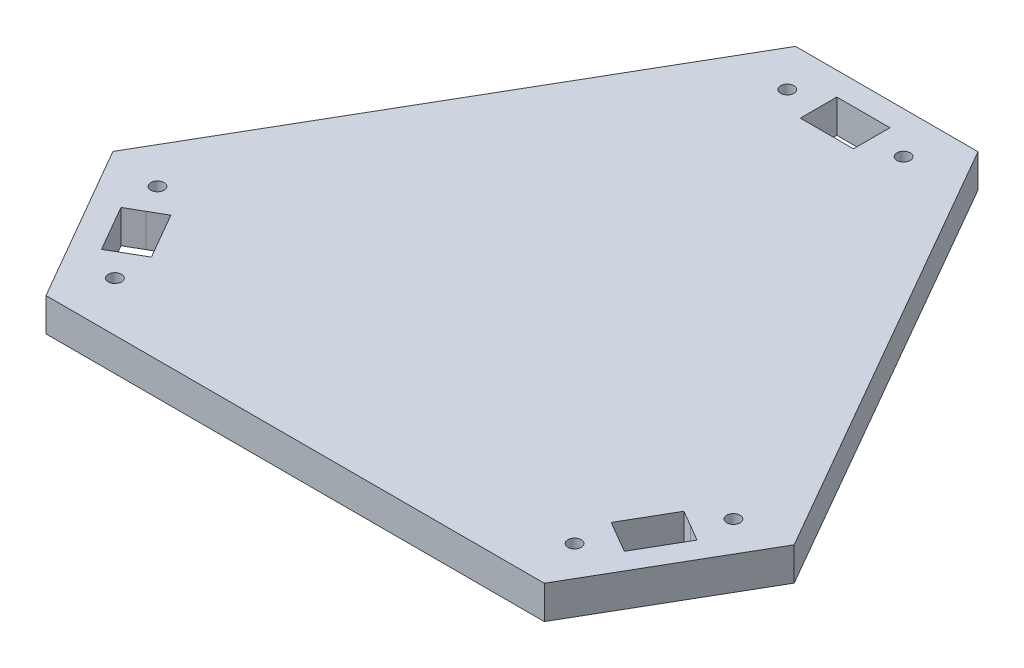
ISO-10303-21;
HEADER;
FILE_DESCRIPTION(('STEP AP214'),'2;1');
FILE_NAME('part.step','',(''),(''),'','','');
FILE_SCHEMA(('AUTOMOTIVE_DESIGN { 1 0 10303 214 1 1 1 1 }'));
ENDSEC;
DATA;
#1=APPLICATION_CONTEXT('core data for automotive mechanical design processes');
#2=APPLICATION_PROTOCOL_DEFINITION('international standard','automotive_design',2000,#1);
#3=PRODUCT_CONTEXT('',#1,'mechanical');
#4=PRODUCT('Part','Part','',(#3));
#5=PRODUCT_RELATED_PRODUCT_CATEGORY('part','',(#4));
#6=PRODUCT_DEFINITION_FORMATION('','',#4);
#7=PRODUCT_DEFINITION_CONTEXT('part definition',#1,'design');
#8=PRODUCT_DEFINITION('design','',#6,#7);
#9=PRODUCT_DEFINITION_SHAPE('','',#8);
#10=(LENGTH_UNIT() NAMED_UNIT(*) SI_UNIT(.MILLI.,.METRE.));
#11=(NAMED_UNIT(*) PLANE_ANGLE_UNIT() SI_UNIT($,.RADIAN.));
#12=(NAMED_UNIT(*) SI_UNIT($,.STERADIAN.) SOLID_ANGLE_UNIT());
#13=UNCERTAINTY_MEASURE_WITH_UNIT(LENGTH_MEASURE(1.E-05),#10,'distance_accuracy_value','');
#14=(GEOMETRIC_REPRESENTATION_CONTEXT(3) GLOBAL_UNCERTAINTY_ASSIGNED_CONTEXT((#13)) GLOBAL_UNIT_ASSIGNED_CONTEXT((#10,
#11,#12)) REPRESENTATION_CONTEXT('',''));
#15=CARTESIAN_POINT('',(0.,0.,0.));
#16=DIRECTION('',(0.,0.,1.));
#17=DIRECTION('',(1.,0.,0.));
#18=AXIS2_PLACEMENT_3D('',#15,#16,#17);
#19=CARTESIAN_POINT('',(-54.2371764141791,20.,-355.613027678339));
#20=DIRECTION('',(0.,0.,-1.));
#21=DIRECTION('',(-1.,0.,0.));
#22=AXIS2_PLACEMENT_3D('',#19,#20,#21);
#23=PLANE('',#22);
#24=DIRECTION('',(1.,0.,0.));
#25=VECTOR('',#24,1.);
#26=CARTESIAN_POINT('',(-54.2371764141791,0.,-355.613027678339));
#27=LINE('',#26,#25);
#28=CARTESIAN_POINT('',(-54.2371764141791,0.,-355.613027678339));
#29=VERTEX_POINT('',#28);
#30=CARTESIAN_POINT('',(55.5843421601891,0.,-355.613027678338));
#31=VERTEX_POINT('',#30);
#32=EDGE_CURVE('E306',#29,#31,#27,.T.);
#33=ORIENTED_EDGE('',*,*,#32,.F.);
#34=DIRECTION('',(0.,-1.,0.));
#35=VECTOR('',#34,1.);
#36=CARTESIAN_POINT('',(-54.2371764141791,20.,-355.613027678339));
#37=LINE('',#36,#35);
#38=CARTESIAN_POINT('',(-54.2371764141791,20.,-355.613027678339));
#39=VERTEX_POINT('',#38);
#40=EDGE_CURVE('E11',#39,#29,#37,.T.);
#41=ORIENTED_EDGE('',*,*,#40,.F.);
#42=DIRECTION('',(1.,0.,0.));
#43=VECTOR('',#42,1.);
#44=CARTESIAN_POINT('',(-54.2371764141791,20.,-355.613027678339));
#45=LINE('',#44,#43);
#46=CARTESIAN_POINT('',(55.5843421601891,20.,-355.613027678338));
#47=VERTEX_POINT('',#46);
#48=EDGE_CURVE('E317',#39,#47,#45,.T.);
#49=ORIENTED_EDGE('',*,*,#48,.T.);
#50=DIRECTION('',(0.,-1.,0.));
#51=VECTOR('',#50,1.);
#52=CARTESIAN_POINT('',(55.5843421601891,20.,-355.613027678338));
#53=LINE('',#52,#51);
#54=EDGE_CURVE('E35',#47,#31,#53,.T.);
#55=ORIENTED_EDGE('',*,*,#54,.T.);
#56=EDGE_LOOP('',(#33,#41,#49,#55));
#57=FACE_BOUND('',#56,.T.);
#58=ADVANCED_FACE('F32',(#57),#23,.T.);
#59=CARTESIAN_POINT('',(-54.2371764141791,20.,-355.613027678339));
#60=DIRECTION('',(0.865353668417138,0.,0.501161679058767));
#61=DIRECTION('',(0.501161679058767,0.,-0.865353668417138));
#62=AXIS2_PLACEMENT_3D('',#59,#60,#61);
#63=PLANE('',#62);
#64=DIRECTION('',(-0.501161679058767,0.,0.865353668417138));
#65=VECTOR('',#64,1.);
#66=CARTESIAN_POINT('',(-54.2371764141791,0.,-355.613027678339));
#67=LINE('',#66,#65);
#68=CARTESIAN_POINT('',(-204.994277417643,0.,-95.3014040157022));
#69=VERTEX_POINT('',#68);
#70=EDGE_CURVE('E321',#29,#69,#67,.T.);
#71=ORIENTED_EDGE('',*,*,#70,.T.);
#72=DIRECTION('',(0.,-1.,0.));
#73=VECTOR('',#72,1.);
#74=CARTESIAN_POINT('',(-204.994277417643,20.,-95.3014040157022));
#75=LINE('',#74,#73);
#76=CARTESIAN_POINT('',(-204.994277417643,20.,-95.3014040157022));
#77=VERTEX_POINT('',#76);
#78=EDGE_CURVE('E40',#77,#69,#75,.T.);
#79=ORIENTED_EDGE('',*,*,#78,.F.);
#80=DIRECTION('',(-0.501161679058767,0.,0.865353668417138));
#81=VECTOR('',#80,1.);
#82=CARTESIAN_POINT('',(-54.2371764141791,20.,-355.613027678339));
#83=LINE('',#82,#81);
#84=EDGE_CURVE('E331',#39,#77,#83,.T.);
#85=ORIENTED_EDGE('',*,*,#84,.F.);
#86=ORIENTED_EDGE('',*,*,#40,.T.);
#87=EDGE_LOOP('',(#71,#79,#85,#86));
#88=FACE_BOUND('',#87,.T.);
#89=ADVANCED_FACE('F369',(#88),#63,.F.);
#90=CARTESIAN_POINT('',(-149.988554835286,20.,0.));
#91=DIRECTION('',(-0.866090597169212,0.,0.499887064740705));
#92=DIRECTION('',(0.499887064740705,0.,0.866090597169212));
#93=AXIS2_PLACEMENT_3D('',#90,#91,#92);
#94=PLANE('',#93);
#95=DIRECTION('',(-0.499887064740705,0.,-0.866090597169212));
#96=VECTOR('',#95,1.);
#97=CARTESIAN_POINT('',(-149.988554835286,0.,0.));
#98=LINE('',#97,#96);
#99=CARTESIAN_POINT('',(-149.988554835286,0.,0.));
#100=VERTEX_POINT('',#99);
#101=EDGE_CURVE('E344',#100,#69,#98,.T.);
#102=ORIENTED_EDGE('',*,*,#101,.F.);
#103=DIRECTION('',(0.,-1.,0.));
#104=VECTOR('',#103,1.);
#105=CARTESIAN_POINT('',(-149.988554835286,20.,0.));
#106=LINE('',#105,#104);
#107=CARTESIAN_POINT('',(-149.988554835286,20.,0.));
#108=VERTEX_POINT('',#107);
#109=EDGE_CURVE('E350',#108,#100,#106,.T.);
#110=ORIENTED_EDGE('',*,*,#109,.F.);
#111=DIRECTION('',(-0.499887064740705,0.,-0.866090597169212));
#112=VECTOR('',#111,1.);
#113=CARTESIAN_POINT('',(-149.988554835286,20.,0.));
#114=LINE('',#113,#112);
#115=EDGE_CURVE('E328',#108,#77,#114,.T.);
#116=ORIENTED_EDGE('',*,*,#115,.T.);
#117=ORIENTED_EDGE('',*,*,#78,.T.);
#118=EDGE_LOOP('',(#102,#110,#116,#117));
#119=FACE_BOUND('',#118,.T.);
#120=ADVANCED_FACE('F381',(#119),#94,.T.);
#121=CARTESIAN_POINT('',(-149.988554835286,20.,0.));
#122=DIRECTION('',(0.,0.,-1.));
#123=DIRECTION('',(-1.,0.,0.));
#124=AXIS2_PLACEMENT_3D('',#121,#122,#123);
#125=PLANE('',#124);
#126=DIRECTION('',(1.,0.,0.));
#127=VECTOR('',#126,1.);
#128=CARTESIAN_POINT('',(-149.988554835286,0.,0.));
#129=LINE('',#128,#127);
#130=CARTESIAN_POINT('',(150.075497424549,0.,0.));
#131=VERTEX_POINT('',#130);
#132=EDGE_CURVE('E341',#100,#131,#129,.T.);
#133=ORIENTED_EDGE('',*,*,#132,.T.);
#134=DIRECTION('',(0.,-1.,0.));
#135=VECTOR('',#134,1.);
#136=CARTESIAN_POINT('',(150.075497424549,20.,0.));
#137=LINE('',#136,#135);
#138=CARTESIAN_POINT('',(150.075497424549,20.,0.));
#139=VERTEX_POINT('',#138);
#140=EDGE_CURVE('E352',#139,#131,#137,.T.);
#141=ORIENTED_EDGE('',*,*,#140,.F.);
#142=DIRECTION('',(1.,0.,0.));
#143=VECTOR('',#142,1.);
#144=CARTESIAN_POINT('',(-149.988554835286,20.,0.));
#145=LINE('',#144,#143);
#146=EDGE_CURVE('E326',#108,#139,#145,.T.);
#147=ORIENTED_EDGE('',*,*,#146,.F.);
#148=ORIENTED_EDGE('',*,*,#109,.T.);
#149=EDGE_LOOP('',(#133,#141,#147,#148));
#150=FACE_BOUND('',#149,.T.);
#151=ADVANCED_FACE('F382',(#150),#125,.F.);
#152=CARTESIAN_POINT('',(205.21826345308,20.,-95.3014040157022));
#153=DIRECTION('',(0.865551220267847,0.,0.500820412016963));
#154=DIRECTION('',(0.500820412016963,0.,-0.865551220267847));
#155=AXIS2_PLACEMENT_3D('',#152,#153,#154);
#156=PLANE('',#155);
#157=DIRECTION('',(-0.500820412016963,0.,0.865551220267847));
#158=VECTOR('',#157,1.);
#159=CARTESIAN_POINT('',(205.21826345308,0.,-95.3014040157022));
#160=LINE('',#159,#158);
#161=CARTESIAN_POINT('',(205.21826345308,0.,-95.3014040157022));
#162=VERTEX_POINT('',#161);
#163=EDGE_CURVE('E338',#162,#131,#160,.T.);
#164=ORIENTED_EDGE('',*,*,#163,.F.);
#165=DIRECTION('',(0.,-1.,0.));
#166=VECTOR('',#165,1.);
#167=CARTESIAN_POINT('',(205.21826345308,20.,-95.3014040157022));
#168=LINE('',#167,#166);
#169=CARTESIAN_POINT('',(205.21826345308,20.,-95.3014040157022));
#170=VERTEX_POINT('',#169);
#171=EDGE_CURVE('E353',#170,#162,#168,.T.);
#172=ORIENTED_EDGE('',*,*,#171,.F.);
#173=DIRECTION('',(-0.500820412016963,0.,0.865551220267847));
#174=VECTOR('',#173,1.);
#175=CARTESIAN_POINT('',(205.21826345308,20.,-95.3014040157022));
#176=LINE('',#175,#174);
#177=EDGE_CURVE('E323',#170,#139,#176,.T.);
#178=ORIENTED_EDGE('',*,*,#177,.T.);
#179=ORIENTED_EDGE('',*,*,#140,.T.);
#180=EDGE_LOOP('',(#164,#172,#178,#179));
#181=FACE_BOUND('',#180,.T.);
#182=ADVANCED_FACE('F378',(#181),#156,.T.);
#183=CARTESIAN_POINT('',(205.21826345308,20.,-95.3014040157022));
#184=DIRECTION('',(-0.866971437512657,0.,0.498357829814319));
#185=DIRECTION('',(0.498357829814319,0.,0.866971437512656));
#186=AXIS2_PLACEMENT_3D('',#183,#184,#185);
#187=PLANE('',#186);
#188=DIRECTION('',(-0.498357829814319,0.,-0.866971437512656));
#189=VECTOR('',#188,1.);
#190=CARTESIAN_POINT('',(205.21826345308,0.,-95.3014040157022));
#191=LINE('',#190,#189);
#192=EDGE_CURVE('E335',#162,#31,#191,.T.);
#193=ORIENTED_EDGE('',*,*,#192,.T.);
#194=ORIENTED_EDGE('',*,*,#54,.F.);
#195=DIRECTION('',(-0.498357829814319,0.,-0.866971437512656));
#196=VECTOR('',#195,1.);
#197=CARTESIAN_POINT('',(205.21826345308,20.,-95.3014040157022));
#198=LINE('',#197,#196);
#199=EDGE_CURVE('E320',#170,#47,#198,.T.);
#200=ORIENTED_EDGE('',*,*,#199,.F.);
#201=ORIENTED_EDGE('',*,*,#171,.T.);
#202=EDGE_LOOP('',(#193,#194,#200,#201));
#203=FACE_BOUND('',#202,.T.);
#204=ADVANCED_FACE('F361',(#203),#187,.F.);
#205=CARTESIAN_POINT('',(0.,20.,0.));
#206=DIRECTION('',(0.,1.,0.));
#207=DIRECTION('',(0.,0.,1.));
#208=AXIS2_PLACEMENT_3D('',#205,#206,#207);
#209=PLANE('',#208);
#210=CARTESIAN_POINT('',(-138.352176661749,20.,-29.8504268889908));
#211=DIRECTION('',(0.,1.,0.));
#212=DIRECTION('',(0.,0.,1.));
#213=AXIS2_PLACEMENT_3D('',#210,#211,#212);
#214=CIRCLE('',#213,3.99999999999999);
#215=CARTESIAN_POINT('',(-138.352176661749,20.,-25.8504268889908));
#216=VERTEX_POINT('',#215);
#217=EDGE_CURVE('E516',#216,#216,#214,.T.);
#218=ORIENTED_EDGE('',*,*,#217,.F.);
#219=EDGE_LOOP('',(#218));
#220=FACE_BOUND('',#219,.T.);
#221=CARTESIAN_POINT('',(-173.344271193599,20.,-90.4767686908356));
#222=DIRECTION('',(0.,1.,0.));
#223=DIRECTION('',(0.,0.,1.));
#224=AXIS2_PLACEMENT_3D('',#221,#222,#223);
#225=CIRCLE('',#224,3.99999999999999);
#226=CARTESIAN_POINT('',(-173.344271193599,20.,-86.4767686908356));
#227=VERTEX_POINT('',#226);
#228=EDGE_CURVE('E515',#227,#227,#225,.T.);
#229=ORIENTED_EDGE('',*,*,#228,.F.);
#230=EDGE_LOOP('',(#229));
#231=FACE_BOUND('',#230,.T.);
#232=CARTESIAN_POINT('',(35.7628235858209,20.,-330.613027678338));
#233=DIRECTION('',(0.,1.,0.));
#234=DIRECTION('',(0.,0.,1.));
#235=AXIS2_PLACEMENT_3D('',#232,#233,#234);
#236=CIRCLE('',#235,4.00000000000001);
#237=CARTESIAN_POINT('',(35.7628235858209,20.,-326.613027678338));
#238=VERTEX_POINT('',#237);
#239=EDGE_CURVE('E525',#238,#238,#236,.T.);
#240=ORIENTED_EDGE('',*,*,#239,.F.);
#241=EDGE_LOOP('',(#240));
#242=FACE_BOUND('',#241,.T.);
#243=CARTESIAN_POINT('',(-34.2371764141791,20.,-330.613027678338));
#244=DIRECTION('',(0.,1.,0.));
#245=DIRECTION('',(0.,0.,1.));
#246=AXIS2_PLACEMENT_3D('',#243,#244,#245);
#247=CIRCLE('',#246,4.);
#248=CARTESIAN_POINT('',(-34.2371764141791,20.,-326.613027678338));
#249=VERTEX_POINT('',#248);
#250=EDGE_CURVE('E530',#249,#249,#247,.T.);
#251=ORIENTED_EDGE('',*,*,#250,.F.);
#252=EDGE_LOOP('',(#251));
#253=FACE_BOUND('',#252,.T.);
#254=CARTESIAN_POINT('',(138.453125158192,20.,-29.831534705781));
#255=DIRECTION('',(0.,1.,0.));
#256=DIRECTION('',(0.,0.,1.));
#257=AXIS2_PLACEMENT_3D('',#254,#255,#256);
#258=CIRCLE('',#257,3.99999999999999);
#259=CARTESIAN_POINT('',(138.453125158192,20.,-25.831534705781));
#260=VERTEX_POINT('',#259);
#261=EDGE_CURVE('E536',#260,#260,#258,.T.);
#262=ORIENTED_EDGE('',*,*,#261,.F.);
#263=EDGE_LOOP('',(#262));
#264=FACE_BOUND('',#263,.T.);
#265=CARTESIAN_POINT('',(173.51055399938,20.,-90.4201201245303));
#266=DIRECTION('',(0.,1.,0.));
#267=DIRECTION('',(0.,0.,1.));
#268=AXIS2_PLACEMENT_3D('',#265,#266,#267);
#269=CIRCLE('',#268,3.99999999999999);
#270=CARTESIAN_POINT('',(173.51055399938,20.,-86.4201201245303));
#271=VERTEX_POINT('',#270);
#272=EDGE_CURVE('E542',#271,#271,#269,.T.);
#273=ORIENTED_EDGE('',*,*,#272,.F.);
#274=EDGE_LOOP('',(#273));
#275=FACE_BOUND('',#274,.T.);
#276=DIRECTION('',(-1.,0.,0.));
#277=VECTOR('',#276,1.);
#278=CARTESIAN_POINT('',(16.5843421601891,20.,-341.613027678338));
#279=LINE('',#278,#277);
#280=CARTESIAN_POINT('',(16.5843421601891,20.,-341.613027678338));
#281=VERTEX_POINT('',#280);
#282=CARTESIAN_POINT('',(-15.4156578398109,20.,-341.613027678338));
#283=VERTEX_POINT('',#282);
#284=EDGE_CURVE('E48',#281,#283,#279,.T.);
#285=ORIENTED_EDGE('',*,*,#284,.F.);
#286=DIRECTION('',(0.,0.,-1.));
#287=VECTOR('',#286,1.);
#288=CARTESIAN_POINT('',(16.5843421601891,20.,-319.613027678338));
#289=LINE('',#288,#287);
#290=CARTESIAN_POINT('',(16.5843421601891,20.,-319.613027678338));
#291=VERTEX_POINT('',#290);
#292=EDGE_CURVE('E213',#291,#281,#289,.T.);
#293=ORIENTED_EDGE('',*,*,#292,.F.);
#294=DIRECTION('',(1.,0.,0.));
#295=VECTOR('',#294,1.);
#296=CARTESIAN_POINT('',(-15.4156578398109,20.,-319.613027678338));
#297=LINE('',#296,#295);
#298=CARTESIAN_POINT('',(-15.4156578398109,20.,-319.613027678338));
#299=VERTEX_POINT('',#298);
#300=EDGE_CURVE('E183',#299,#291,#297,.T.);
#301=ORIENTED_EDGE('',*,*,#300,.F.);
#302=DIRECTION('',(0.,0.,1.));
#303=VECTOR('',#302,1.);
#304=CARTESIAN_POINT('',(-15.4156578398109,20.,-330.613027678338));
#305=LINE('',#304,#303);
#306=EDGE_CURVE('E208',#283,#299,#305,.T.);
#307=ORIENTED_EDGE('',*,*,#306,.F.);
#308=EDGE_LOOP('',(#285,#293,#301,#307));
#309=FACE_BOUND('',#308,.T.);
#310=DIRECTION('',(-0.860737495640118,0.,-0.509049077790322));
#311=VECTOR('',#310,1.);
#312=CARTESIAN_POINT('',(173.516029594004,20.,-68.4656224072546));
#313=LINE('',#312,#311);
#314=CARTESIAN_POINT('',(173.516029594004,20.,-68.4656224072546));
#315=VERTEX_POINT('',#314);
#316=CARTESIAN_POINT('',(164.047486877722,20.,-74.0654167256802));
#317=VERTEX_POINT('',#316);
#318=EDGE_CURVE('E218',#315,#317,#313,.T.);
#319=ORIENTED_EDGE('',*,*,#318,.F.);
#320=DIRECTION('',(0.500820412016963,0.,-0.865551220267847));
#321=VECTOR('',#320,1.);
#322=CARTESIAN_POINT('',(157.489776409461,20.,-40.7679833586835));
#323=LINE('',#322,#321);
#324=CARTESIAN_POINT('',(157.489776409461,20.,-40.7679833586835));
#325=VERTEX_POINT('',#324);
#326=EDGE_CURVE('E225',#325,#315,#323,.T.);
#327=ORIENTED_EDGE('',*,*,#326,.F.);
#328=DIRECTION('',(0.865551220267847,0.,0.500820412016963));
#329=VECTOR('',#328,1.);
#330=CARTESIAN_POINT('',(147.968712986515,20.,-46.2770078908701));
#331=LINE('',#330,#329);
#332=CARTESIAN_POINT('',(147.968712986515,20.,-46.2770078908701));
#333=VERTEX_POINT('',#332);
#334=EDGE_CURVE('E251',#333,#325,#331,.T.);
#335=ORIENTED_EDGE('',*,*,#334,.F.);
#336=DIRECTION('',(0.860737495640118,0.,0.509049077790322));
#337=VECTOR('',#336,1.);
#338=CARTESIAN_POINT('',(138.500170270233,20.,-51.8768022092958));
#339=LINE('',#338,#337);
#340=CARTESIAN_POINT('',(138.500170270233,20.,-51.8768022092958));
#341=VERTEX_POINT('',#340);
#342=EDGE_CURVE('E248',#341,#333,#339,.T.);
#343=ORIENTED_EDGE('',*,*,#342,.F.);
#344=DIRECTION('',(-0.500820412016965,0.,0.865551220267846));
#345=VECTOR('',#344,1.);
#346=CARTESIAN_POINT('',(154.526423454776,20.,-79.5744412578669));
#347=LINE('',#346,#345);
#348=CARTESIAN_POINT('',(154.526423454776,20.,-79.5744412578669));
#349=VERTEX_POINT('',#348);
#350=EDGE_CURVE('E245',#349,#341,#347,.T.);
#351=ORIENTED_EDGE('',*,*,#350,.F.);
#352=DIRECTION('',(-0.865551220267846,0.,-0.500820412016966));
#353=VECTOR('',#352,1.);
#354=CARTESIAN_POINT('',(164.047486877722,20.,-74.0654167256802));
#355=LINE('',#354,#353);
#356=EDGE_CURVE('E242',#317,#349,#355,.T.);
#357=ORIENTED_EDGE('',*,*,#356,.F.);
#358=EDGE_LOOP('',(#319,#327,#335,#343,#351,#357));
#359=FACE_BOUND('',#358,.T.);
#360=DIRECTION('',(-0.499887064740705,0.,-0.866090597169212));
#361=VECTOR('',#360,1.);
#362=CARTESIAN_POINT('',(-138.304888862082,20.,-51.7734676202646));
#363=LINE('',#362,#361);
#364=CARTESIAN_POINT('',(-138.304888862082,20.,-51.7734676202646));
#365=VERTEX_POINT('',#364);
#366=CARTESIAN_POINT('',(-154.301274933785,20.,-79.4883667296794));
#367=VERTEX_POINT('',#366);
#368=EDGE_CURVE('E258',#365,#367,#363,.T.);
#369=ORIENTED_EDGE('',*,*,#368,.F.);
#370=DIRECTION('',(0.866090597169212,0.,-0.499887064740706));
#371=VECTOR('',#370,1.);
#372=CARTESIAN_POINT('',(-147.831885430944,20.,-46.2747099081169));
#373=LINE('',#372,#371);
#374=CARTESIAN_POINT('',(-147.831885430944,20.,-46.2747099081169));
#375=VERTEX_POINT('',#374);
#376=EDGE_CURVE('E273',#375,#365,#373,.T.);
#377=ORIENTED_EDGE('',*,*,#376,.F.);
#378=DIRECTION('',(0.867735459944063,0.,-0.497026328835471));
#379=VECTOR('',#378,1.);
#380=CARTESIAN_POINT('',(-157.377027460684,20.,-40.807390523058));
#381=LINE('',#380,#379);
#382=CARTESIAN_POINT('',(-157.377027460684,20.,-40.807390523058));
#383=VERTEX_POINT('',#382);
#384=EDGE_CURVE('E299',#383,#375,#381,.T.);
#385=ORIENTED_EDGE('',*,*,#384,.F.);
#386=DIRECTION('',(0.499887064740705,0.,0.866090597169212));
#387=VECTOR('',#386,1.);
#388=CARTESIAN_POINT('',(-173.373413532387,20.,-68.5222896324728));
#389=LINE('',#388,#387);
#390=CARTESIAN_POINT('',(-173.373413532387,20.,-68.5222896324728));
#391=VERTEX_POINT('',#390);
#392=EDGE_CURVE('E296',#391,#383,#389,.T.);
#393=ORIENTED_EDGE('',*,*,#392,.F.);
#394=DIRECTION('',(-0.866090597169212,0.,0.499887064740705));
#395=VECTOR('',#394,1.);
#396=CARTESIAN_POINT('',(-163.846416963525,20.,-74.0210473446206));
#397=LINE('',#396,#395);
#398=CARTESIAN_POINT('',(-163.846416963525,20.,-74.0210473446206));
#399=VERTEX_POINT('',#398);
#400=EDGE_CURVE('E293',#399,#391,#397,.T.);
#401=ORIENTED_EDGE('',*,*,#400,.F.);
#402=DIRECTION('',(-0.867735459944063,0.,0.49702632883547));
#403=VECTOR('',#402,1.);
#404=CARTESIAN_POINT('',(-154.301274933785,20.,-79.4883667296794));
#405=LINE('',#404,#403);
#406=EDGE_CURVE('E290',#367,#399,#405,.T.);
#407=ORIENTED_EDGE('',*,*,#406,.F.);
#408=EDGE_LOOP('',(#369,#377,#385,#393,#401,#407));
#409=FACE_BOUND('',#408,.T.);
#410=ORIENTED_EDGE('',*,*,#48,.F.);
#411=ORIENTED_EDGE('',*,*,#84,.T.);
#412=ORIENTED_EDGE('',*,*,#115,.F.);
#413=ORIENTED_EDGE('',*,*,#146,.T.);
#414=ORIENTED_EDGE('',*,*,#177,.F.);
#415=ORIENTED_EDGE('',*,*,#199,.T.);
#416=EDGE_LOOP('',(#410,#411,#412,#413,#414,#415));
#417=FACE_BOUND('',#416,.T.);
#418=ADVANCED_FACE('F373',(#220,#231,#242,#253,#264,#275,#309,#359,#409,#417),#209,.T.);
#419=CARTESIAN_POINT('',(0.,0.,0.));
#420=DIRECTION('',(0.,1.,0.));
#421=DIRECTION('',(0.,0.,1.));
#422=AXIS2_PLACEMENT_3D('',#419,#420,#421);
#423=PLANE('',#422);
#424=DIRECTION('',(0.,0.,-1.));
#425=VECTOR('',#424,1.);
#426=CARTESIAN_POINT('',(16.5843421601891,0.,-319.613027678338));
#427=LINE('',#426,#425);
#428=CARTESIAN_POINT('',(16.5843421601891,0.,-319.613027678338));
#429=VERTEX_POINT('',#428);
#430=CARTESIAN_POINT('',(16.5843421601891,0.,-341.613027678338));
#431=VERTEX_POINT('',#430);
#432=EDGE_CURVE('E191',#429,#431,#427,.T.);
#433=ORIENTED_EDGE('',*,*,#432,.T.);
#434=DIRECTION('',(-1.,0.,0.));
#435=VECTOR('',#434,1.);
#436=CARTESIAN_POINT('',(16.5843421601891,0.,-341.613027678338));
#437=LINE('',#436,#435);
#438=CARTESIAN_POINT('',(-15.4156578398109,0.,-341.613027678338));
#439=VERTEX_POINT('',#438);
#440=EDGE_CURVE('E196',#431,#439,#437,.T.);
#441=ORIENTED_EDGE('',*,*,#440,.T.);
#442=DIRECTION('',(0.,0.,1.));
#443=VECTOR('',#442,1.);
#444=CARTESIAN_POINT('',(-15.4156578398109,0.,-341.613027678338));
#445=LINE('',#444,#443);
#446=CARTESIAN_POINT('',(-15.4156578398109,0.,-319.613027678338));
#447=VERTEX_POINT('',#446);
#448=EDGE_CURVE('E202',#439,#447,#445,.T.);
#449=ORIENTED_EDGE('',*,*,#448,.T.);
#450=DIRECTION('',(1.,0.,0.));
#451=VECTOR('',#450,1.);
#452=CARTESIAN_POINT('',(-15.4156578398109,0.,-319.613027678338));
#453=LINE('',#452,#451);
#454=EDGE_CURVE('E56',#447,#429,#453,.T.);
#455=ORIENTED_EDGE('',*,*,#454,.T.);
#456=EDGE_LOOP('',(#433,#441,#449,#455));
#457=FACE_BOUND('',#456,.T.);
#458=DIRECTION('',(0.500820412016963,0.,-0.865551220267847));
#459=VECTOR('',#458,1.);
#460=CARTESIAN_POINT('',(157.489776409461,0.,-40.7679833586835));
#461=LINE('',#460,#459);
#462=CARTESIAN_POINT('',(157.489776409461,0.,-40.7679833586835));
#463=VERTEX_POINT('',#462);
#464=CARTESIAN_POINT('',(173.516029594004,0.,-68.4656224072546));
#465=VERTEX_POINT('',#464);
#466=EDGE_CURVE('E237',#463,#465,#461,.T.);
#467=ORIENTED_EDGE('',*,*,#466,.T.);
#468=DIRECTION('',(-0.860737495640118,0.,-0.509049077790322));
#469=VECTOR('',#468,1.);
#470=CARTESIAN_POINT('',(173.516029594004,0.,-68.4656224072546));
#471=LINE('',#470,#469);
#472=CARTESIAN_POINT('',(164.047486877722,0.,-74.0654167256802));
#473=VERTEX_POINT('',#472);
#474=EDGE_CURVE('E221',#465,#473,#471,.T.);
#475=ORIENTED_EDGE('',*,*,#474,.T.);
#476=DIRECTION('',(-0.865551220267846,0.,-0.500820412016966));
#477=VECTOR('',#476,1.);
#478=CARTESIAN_POINT('',(164.047486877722,0.,-74.0654167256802));
#479=LINE('',#478,#477);
#480=CARTESIAN_POINT('',(154.526423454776,0.,-79.5744412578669));
#481=VERTEX_POINT('',#480);
#482=EDGE_CURVE('E224',#473,#481,#479,.T.);
#483=ORIENTED_EDGE('',*,*,#482,.T.);
#484=DIRECTION('',(-0.500820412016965,0.,0.865551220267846));
#485=VECTOR('',#484,1.);
#486=CARTESIAN_POINT('',(154.526423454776,0.,-79.5744412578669));
#487=LINE('',#486,#485);
#488=CARTESIAN_POINT('',(138.500170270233,0.,-51.8768022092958));
#489=VERTEX_POINT('',#488);
#490=EDGE_CURVE('E228',#481,#489,#487,.T.);
#491=ORIENTED_EDGE('',*,*,#490,.T.);
#492=DIRECTION('',(0.860737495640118,0.,0.509049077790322));
#493=VECTOR('',#492,1.);
#494=CARTESIAN_POINT('',(138.500170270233,0.,-51.8768022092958));
#495=LINE('',#494,#493);
#496=CARTESIAN_POINT('',(147.968712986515,0.,-46.2770078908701));
#497=VERTEX_POINT('',#496);
#498=EDGE_CURVE('E231',#489,#497,#495,.T.);
#499=ORIENTED_EDGE('',*,*,#498,.T.);
#500=DIRECTION('',(0.865551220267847,0.,0.500820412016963));
#501=VECTOR('',#500,1.);
#502=CARTESIAN_POINT('',(147.968712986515,0.,-46.2770078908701));
#503=LINE('',#502,#501);
#504=EDGE_CURVE('E234',#497,#463,#503,.T.);
#505=ORIENTED_EDGE('',*,*,#504,.T.);
#506=EDGE_LOOP('',(#467,#475,#483,#491,#499,#505));
#507=FACE_BOUND('',#506,.T.);
#508=DIRECTION('',(0.866090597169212,0.,-0.499887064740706));
#509=VECTOR('',#508,1.);
#510=CARTESIAN_POINT('',(-147.831885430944,0.,-46.2747099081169));
#511=LINE('',#510,#509);
#512=CARTESIAN_POINT('',(-147.831885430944,0.,-46.2747099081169));
#513=VERTEX_POINT('',#512);
#514=CARTESIAN_POINT('',(-138.304888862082,0.,-51.7734676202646));
#515=VERTEX_POINT('',#514);
#516=EDGE_CURVE('E285',#513,#515,#511,.T.);
#517=ORIENTED_EDGE('',*,*,#516,.T.);
#518=DIRECTION('',(-0.499887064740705,0.,-0.866090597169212));
#519=VECTOR('',#518,1.);
#520=CARTESIAN_POINT('',(-138.304888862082,0.,-51.7734676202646));
#521=LINE('',#520,#519);
#522=CARTESIAN_POINT('',(-154.301274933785,0.,-79.4883667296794));
#523=VERTEX_POINT('',#522);
#524=EDGE_CURVE('E269',#515,#523,#521,.T.);
#525=ORIENTED_EDGE('',*,*,#524,.T.);
#526=DIRECTION('',(-0.867735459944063,0.,0.49702632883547));
#527=VECTOR('',#526,1.);
#528=CARTESIAN_POINT('',(-154.301274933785,0.,-79.4883667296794));
#529=LINE('',#528,#527);
#530=CARTESIAN_POINT('',(-163.846416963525,0.,-74.0210473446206));
#531=VERTEX_POINT('',#530);
#532=EDGE_CURVE('E272',#523,#531,#529,.T.);
#533=ORIENTED_EDGE('',*,*,#532,.T.);
#534=DIRECTION('',(-0.866090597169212,0.,0.499887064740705));
#535=VECTOR('',#534,1.);
#536=CARTESIAN_POINT('',(-163.846416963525,0.,-74.0210473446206));
#537=LINE('',#536,#535);
#538=CARTESIAN_POINT('',(-173.373413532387,0.,-68.5222896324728));
#539=VERTEX_POINT('',#538);
#540=EDGE_CURVE('E276',#531,#539,#537,.T.);
#541=ORIENTED_EDGE('',*,*,#540,.T.);
#542=DIRECTION('',(0.499887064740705,0.,0.866090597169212));
#543=VECTOR('',#542,1.);
#544=CARTESIAN_POINT('',(-173.373413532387,0.,-68.5222896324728));
#545=LINE('',#544,#543);
#546=CARTESIAN_POINT('',(-157.377027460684,0.,-40.807390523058));
#547=VERTEX_POINT('',#546);
#548=EDGE_CURVE('E279',#539,#547,#545,.T.);
#549=ORIENTED_EDGE('',*,*,#548,.T.);
#550=DIRECTION('',(0.867735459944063,0.,-0.497026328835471));
#551=VECTOR('',#550,1.);
#552=CARTESIAN_POINT('',(-157.377027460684,0.,-40.807390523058));
#553=LINE('',#552,#551);
#554=EDGE_CURVE('E282',#547,#513,#553,.T.);
#555=ORIENTED_EDGE('',*,*,#554,.T.);
#556=EDGE_LOOP('',(#517,#525,#533,#541,#549,#555));
#557=FACE_BOUND('',#556,.T.);
#558=ORIENTED_EDGE('',*,*,#32,.T.);
#559=ORIENTED_EDGE('',*,*,#192,.F.);
#560=ORIENTED_EDGE('',*,*,#163,.T.);
#561=ORIENTED_EDGE('',*,*,#132,.F.);
#562=ORIENTED_EDGE('',*,*,#101,.T.);
#563=ORIENTED_EDGE('',*,*,#70,.F.);
#564=EDGE_LOOP('',(#558,#559,#560,#561,#562,#563));
#565=FACE_BOUND('',#564,.T.);
#566=ADVANCED_FACE('F199',(#457,#507,#557,#565),#423,.F.);
#567=CARTESIAN_POINT('',(-138.304888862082,0.,-51.7734676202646));
#568=DIRECTION('',(0.866090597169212,0.,-0.499887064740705));
#569=DIRECTION('',(-0.499887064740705,0.,-0.866090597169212));
#570=AXIS2_PLACEMENT_3D('',#567,#568,#569);
#571=PLANE('',#570);
#572=ORIENTED_EDGE('',*,*,#368,.T.);
#573=DIRECTION('',(0.,1.,0.));
#574=VECTOR('',#573,1.);
#575=CARTESIAN_POINT('',(-154.301274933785,0.,-79.4883667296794));
#576=LINE('',#575,#574);
#577=EDGE_CURVE('E288',#523,#367,#576,.T.);
#578=ORIENTED_EDGE('',*,*,#577,.F.);
#579=ORIENTED_EDGE('',*,*,#524,.F.);
#580=DIRECTION('',(0.,1.,0.));
#581=VECTOR('',#580,1.);
#582=CARTESIAN_POINT('',(-138.304888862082,0.,-51.7734676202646));
#583=LINE('',#582,#581);
#584=EDGE_CURVE('E304',#515,#365,#583,.T.);
#585=ORIENTED_EDGE('',*,*,#584,.T.);
#586=EDGE_LOOP('',(#572,#578,#579,#585));
#587=FACE_BOUND('',#586,.T.);
#588=ADVANCED_FACE('F401',(#587),#571,.F.);
#589=CARTESIAN_POINT('',(-147.831885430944,0.,-46.2747099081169));
#590=DIRECTION('',(0.499887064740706,0.,0.866090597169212));
#591=DIRECTION('',(0.866090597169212,0.,-0.499887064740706));
#592=AXIS2_PLACEMENT_3D('',#589,#590,#591);
#593=PLANE('',#592);
#594=ORIENTED_EDGE('',*,*,#376,.T.);
#595=ORIENTED_EDGE('',*,*,#584,.F.);
#596=ORIENTED_EDGE('',*,*,#516,.F.);
#597=DIRECTION('',(0.,1.,0.));
#598=VECTOR('',#597,1.);
#599=CARTESIAN_POINT('',(-147.831885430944,0.,-46.2747099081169));
#600=LINE('',#599,#598);
#601=EDGE_CURVE('E307',#513,#375,#600,.T.);
#602=ORIENTED_EDGE('',*,*,#601,.T.);
#603=EDGE_LOOP('',(#594,#595,#596,#602));
#604=FACE_BOUND('',#603,.T.);
#605=ADVANCED_FACE('F407',(#604),#593,.F.);
#606=CARTESIAN_POINT('',(-157.377027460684,0.,-40.807390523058));
#607=DIRECTION('',(0.497026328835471,0.,0.867735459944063));
#608=DIRECTION('',(0.867735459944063,0.,-0.497026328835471));
#609=AXIS2_PLACEMENT_3D('',#606,#607,#608);
#610=PLANE('',#609);
#611=ORIENTED_EDGE('',*,*,#384,.T.);
#612=ORIENTED_EDGE('',*,*,#601,.F.);
#613=ORIENTED_EDGE('',*,*,#554,.F.);
#614=DIRECTION('',(0.,1.,0.));
#615=VECTOR('',#614,1.);
#616=CARTESIAN_POINT('',(-157.377027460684,0.,-40.807390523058));
#617=LINE('',#616,#615);
#618=EDGE_CURVE('E309',#547,#383,#617,.T.);
#619=ORIENTED_EDGE('',*,*,#618,.T.);
#620=EDGE_LOOP('',(#611,#612,#613,#619));
#621=FACE_BOUND('',#620,.T.);
#622=ADVANCED_FACE('F421',(#621),#610,.F.);
#623=CARTESIAN_POINT('',(-173.373413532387,0.,-68.5222896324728));
#624=DIRECTION('',(-0.866090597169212,0.,0.499887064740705));
#625=DIRECTION('',(0.499887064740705,0.,0.866090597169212));
#626=AXIS2_PLACEMENT_3D('',#623,#624,#625);
#627=PLANE('',#626);
#628=ORIENTED_EDGE('',*,*,#392,.T.);
#629=ORIENTED_EDGE('',*,*,#618,.F.);
#630=ORIENTED_EDGE('',*,*,#548,.F.);
#631=DIRECTION('',(0.,1.,0.));
#632=VECTOR('',#631,1.);
#633=CARTESIAN_POINT('',(-173.373413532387,0.,-68.5222896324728));
#634=LINE('',#633,#632);
#635=EDGE_CURVE('E311',#539,#391,#634,.T.);
#636=ORIENTED_EDGE('',*,*,#635,.T.);
#637=EDGE_LOOP('',(#628,#629,#630,#636));
#638=FACE_BOUND('',#637,.T.);
#639=ADVANCED_FACE('F417',(#638),#627,.F.);
#640=CARTESIAN_POINT('',(-163.846416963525,0.,-74.0210473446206));
#641=DIRECTION('',(-0.499887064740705,0.,-0.866090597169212));
#642=DIRECTION('',(-0.866090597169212,0.,0.499887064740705));
#643=AXIS2_PLACEMENT_3D('',#640,#641,#642);
#644=PLANE('',#643);
#645=ORIENTED_EDGE('',*,*,#400,.T.);
#646=ORIENTED_EDGE('',*,*,#635,.F.);
#647=ORIENTED_EDGE('',*,*,#540,.F.);
#648=DIRECTION('',(0.,1.,0.));
#649=VECTOR('',#648,1.);
#650=CARTESIAN_POINT('',(-163.846416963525,0.,-74.0210473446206));
#651=LINE('',#650,#649);
#652=EDGE_CURVE('E313',#531,#399,#651,.T.);
#653=ORIENTED_EDGE('',*,*,#652,.T.);
#654=EDGE_LOOP('',(#645,#646,#647,#653));
#655=FACE_BOUND('',#654,.T.);
#656=ADVANCED_FACE('F413',(#655),#644,.F.);
#657=CARTESIAN_POINT('',(-154.301274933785,0.,-79.4883667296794));
#658=DIRECTION('',(-0.49702632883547,0.,-0.867735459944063));
#659=DIRECTION('',(-0.867735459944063,0.,0.49702632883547));
#660=AXIS2_PLACEMENT_3D('',#657,#658,#659);
#661=PLANE('',#660);
#662=ORIENTED_EDGE('',*,*,#406,.T.);
#663=ORIENTED_EDGE('',*,*,#652,.F.);
#664=ORIENTED_EDGE('',*,*,#532,.F.);
#665=ORIENTED_EDGE('',*,*,#577,.T.);
#666=EDGE_LOOP('',(#662,#663,#664,#665));
#667=FACE_BOUND('',#666,.T.);
#668=ADVANCED_FACE('F409',(#667),#661,.F.);
#669=CARTESIAN_POINT('',(173.516029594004,0.,-68.4656224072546));
#670=DIRECTION('',(0.509049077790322,0.,-0.860737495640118));
#671=DIRECTION('',(-0.860737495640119,0.,-0.509049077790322));
#672=AXIS2_PLACEMENT_3D('',#669,#670,#671);
#673=PLANE('',#672);
#674=ORIENTED_EDGE('',*,*,#318,.T.);
#675=DIRECTION('',(0.,1.,0.));
#676=VECTOR('',#675,1.);
#677=CARTESIAN_POINT('',(164.047486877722,0.,-74.0654167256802));
#678=LINE('',#677,#676);
#679=EDGE_CURVE('E240',#473,#317,#678,.T.);
#680=ORIENTED_EDGE('',*,*,#679,.F.);
#681=ORIENTED_EDGE('',*,*,#474,.F.);
#682=DIRECTION('',(0.,1.,0.));
#683=VECTOR('',#682,1.);
#684=CARTESIAN_POINT('',(173.516029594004,0.,-68.4656224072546));
#685=LINE('',#684,#683);
#686=EDGE_CURVE('E256',#465,#315,#685,.T.);
#687=ORIENTED_EDGE('',*,*,#686,.T.);
#688=EDGE_LOOP('',(#674,#680,#681,#687));
#689=FACE_BOUND('',#688,.T.);
#690=ADVANCED_FACE('F412',(#689),#673,.F.);
#691=CARTESIAN_POINT('',(157.489776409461,0.,-40.7679833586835));
#692=DIRECTION('',(0.865551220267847,0.,0.500820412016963));
#693=DIRECTION('',(0.500820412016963,0.,-0.865551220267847));
#694=AXIS2_PLACEMENT_3D('',#691,#692,#693);
#695=PLANE('',#694);
#696=ORIENTED_EDGE('',*,*,#326,.T.);
#697=ORIENTED_EDGE('',*,*,#686,.F.);
#698=ORIENTED_EDGE('',*,*,#466,.F.);
#699=DIRECTION('',(0.,1.,0.));
#700=VECTOR('',#699,1.);
#701=CARTESIAN_POINT('',(157.489776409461,0.,-40.7679833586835));
#702=LINE('',#701,#700);
#703=EDGE_CURVE('E259',#463,#325,#702,.T.);
#704=ORIENTED_EDGE('',*,*,#703,.T.);
#705=EDGE_LOOP('',(#696,#697,#698,#704));
#706=FACE_BOUND('',#705,.T.);
#707=ADVANCED_FACE('F431',(#706),#695,.F.);
#708=CARTESIAN_POINT('',(147.968712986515,0.,-46.2770078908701));
#709=DIRECTION('',(-0.500820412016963,0.,0.865551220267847));
#710=DIRECTION('',(0.865551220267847,0.,0.500820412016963));
#711=AXIS2_PLACEMENT_3D('',#708,#709,#710);
#712=PLANE('',#711);
#713=ORIENTED_EDGE('',*,*,#334,.T.);
#714=ORIENTED_EDGE('',*,*,#703,.F.);
#715=ORIENTED_EDGE('',*,*,#504,.F.);
#716=DIRECTION('',(0.,1.,0.));
#717=VECTOR('',#716,1.);
#718=CARTESIAN_POINT('',(147.968712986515,0.,-46.2770078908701));
#719=LINE('',#718,#717);
#720=EDGE_CURVE('E261',#497,#333,#719,.T.);
#721=ORIENTED_EDGE('',*,*,#720,.T.);
#722=EDGE_LOOP('',(#713,#714,#715,#721));
#723=FACE_BOUND('',#722,.T.);
#724=ADVANCED_FACE('F445',(#723),#712,.F.);
#725=CARTESIAN_POINT('',(138.500170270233,0.,-51.8768022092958));
#726=DIRECTION('',(-0.509049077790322,0.,0.860737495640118));
#727=DIRECTION('',(0.860737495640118,0.,0.509049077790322));
#728=AXIS2_PLACEMENT_3D('',#725,#726,#727);
#729=PLANE('',#728);
#730=ORIENTED_EDGE('',*,*,#342,.T.);
#731=ORIENTED_EDGE('',*,*,#720,.F.);
#732=ORIENTED_EDGE('',*,*,#498,.F.);
#733=DIRECTION('',(0.,1.,0.));
#734=VECTOR('',#733,1.);
#735=CARTESIAN_POINT('',(138.500170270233,0.,-51.8768022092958));
#736=LINE('',#735,#734);
#737=EDGE_CURVE('E263',#489,#341,#736,.T.);
#738=ORIENTED_EDGE('',*,*,#737,.T.);
#739=EDGE_LOOP('',(#730,#731,#732,#738));
#740=FACE_BOUND('',#739,.T.);
#741=ADVANCED_FACE('F441',(#740),#729,.F.);
#742=CARTESIAN_POINT('',(154.526423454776,0.,-79.5744412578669));
#743=DIRECTION('',(-0.865551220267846,0.,-0.500820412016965));
#744=DIRECTION('',(-0.500820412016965,0.,0.865551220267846));
#745=AXIS2_PLACEMENT_3D('',#742,#743,#744);
#746=PLANE('',#745);
#747=ORIENTED_EDGE('',*,*,#350,.T.);
#748=ORIENTED_EDGE('',*,*,#737,.F.);
#749=ORIENTED_EDGE('',*,*,#490,.F.);
#750=DIRECTION('',(0.,1.,0.));
#751=VECTOR('',#750,1.);
#752=CARTESIAN_POINT('',(154.526423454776,0.,-79.5744412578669));
#753=LINE('',#752,#751);
#754=EDGE_CURVE('E265',#481,#349,#753,.T.);
#755=ORIENTED_EDGE('',*,*,#754,.T.);
#756=EDGE_LOOP('',(#747,#748,#749,#755));
#757=FACE_BOUND('',#756,.T.);
#758=ADVANCED_FACE('F437',(#757),#746,.F.);
#759=CARTESIAN_POINT('',(164.047486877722,0.,-74.0654167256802));
#760=DIRECTION('',(0.500820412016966,0.,-0.865551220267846));
#761=DIRECTION('',(-0.865551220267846,0.,-0.500820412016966));
#762=AXIS2_PLACEMENT_3D('',#759,#760,#761);
#763=PLANE('',#762);
#764=ORIENTED_EDGE('',*,*,#356,.T.);
#765=ORIENTED_EDGE('',*,*,#754,.F.);
#766=ORIENTED_EDGE('',*,*,#482,.F.);
#767=ORIENTED_EDGE('',*,*,#679,.T.);
#768=EDGE_LOOP('',(#764,#765,#766,#767));
#769=FACE_BOUND('',#768,.T.);
#770=ADVANCED_FACE('F433',(#769),#763,.F.);
#771=CARTESIAN_POINT('',(16.5843421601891,0.,-341.613027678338));
#772=DIRECTION('',(0.,0.,-1.));
#773=DIRECTION('',(-1.,0.,0.));
#774=AXIS2_PLACEMENT_3D('',#771,#772,#773);
#775=PLANE('',#774);
#776=ORIENTED_EDGE('',*,*,#284,.T.);
#777=DIRECTION('',(0.,1.,0.));
#778=VECTOR('',#777,1.);
#779=CARTESIAN_POINT('',(-15.4156578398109,0.,-341.613027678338));
#780=LINE('',#779,#778);
#781=EDGE_CURVE('E216',#439,#283,#780,.T.);
#782=ORIENTED_EDGE('',*,*,#781,.F.);
#783=ORIENTED_EDGE('',*,*,#440,.F.);
#784=DIRECTION('',(0.,1.,0.));
#785=VECTOR('',#784,1.);
#786=CARTESIAN_POINT('',(16.5843421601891,0.,-341.613027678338));
#787=LINE('',#786,#785);
#788=EDGE_CURVE('E187',#431,#281,#787,.T.);
#789=ORIENTED_EDGE('',*,*,#788,.T.);
#790=EDGE_LOOP('',(#776,#782,#783,#789));
#791=FACE_BOUND('',#790,.T.);
#792=ADVANCED_FACE('F436',(#791),#775,.F.);
#793=CARTESIAN_POINT('',(16.5843421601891,0.,-319.613027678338));
#794=DIRECTION('',(1.,0.,0.));
#795=DIRECTION('',(0.,0.,-1.));
#796=AXIS2_PLACEMENT_3D('',#793,#794,#795);
#797=PLANE('',#796);
#798=ORIENTED_EDGE('',*,*,#292,.T.);
#799=ORIENTED_EDGE('',*,*,#788,.F.);
#800=ORIENTED_EDGE('',*,*,#432,.F.);
#801=DIRECTION('',(0.,1.,0.));
#802=VECTOR('',#801,1.);
#803=CARTESIAN_POINT('',(16.5843421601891,0.,-319.613027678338));
#804=LINE('',#803,#802);
#805=EDGE_CURVE('E179',#429,#291,#804,.T.);
#806=ORIENTED_EDGE('',*,*,#805,.T.);
#807=EDGE_LOOP('',(#798,#799,#800,#806));
#808=FACE_BOUND('',#807,.T.);
#809=ADVANCED_FACE('F192',(#808),#797,.F.);
#810=CARTESIAN_POINT('',(-15.4156578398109,0.,-319.613027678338));
#811=DIRECTION('',(0.,0.,1.));
#812=DIRECTION('',(1.,0.,0.));
#813=AXIS2_PLACEMENT_3D('',#810,#811,#812);
#814=PLANE('',#813);
#815=ORIENTED_EDGE('',*,*,#300,.T.);
#816=ORIENTED_EDGE('',*,*,#805,.F.);
#817=ORIENTED_EDGE('',*,*,#454,.F.);
#818=DIRECTION('',(0.,1.,0.));
#819=VECTOR('',#818,1.);
#820=CARTESIAN_POINT('',(-15.4156578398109,0.,-319.613027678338));
#821=LINE('',#820,#819);
#822=EDGE_CURVE('E188',#447,#299,#821,.T.);
#823=ORIENTED_EDGE('',*,*,#822,.T.);
#824=EDGE_LOOP('',(#815,#816,#817,#823));
#825=FACE_BOUND('',#824,.T.);
#826=ADVANCED_FACE('F181',(#825),#814,.F.);
#827=CARTESIAN_POINT('',(-15.4156578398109,0.,-330.613027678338));
#828=DIRECTION('',(-1.,0.,0.));
#829=DIRECTION('',(0.,0.,1.));
#830=AXIS2_PLACEMENT_3D('',#827,#828,#829);
#831=PLANE('',#830);
#832=ORIENTED_EDGE('',*,*,#306,.T.);
#833=ORIENTED_EDGE('',*,*,#822,.F.);
#834=ORIENTED_EDGE('',*,*,#448,.F.);
#835=ORIENTED_EDGE('',*,*,#781,.T.);
#836=EDGE_LOOP('',(#832,#833,#834,#835));
#837=FACE_BOUND('',#836,.T.);
#838=ADVANCED_FACE('F453',(#837),#831,.F.);
#839=CARTESIAN_POINT('',(173.51055399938,10.,-90.4201201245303));
#840=DIRECTION('',(0.,1.,0.));
#841=DIRECTION('',(0.,0.,1.));
#842=AXIS2_PLACEMENT_3D('',#839,#840,#841);
#843=CYLINDRICAL_SURFACE('',#842,3.99999999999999);
#844=CARTESIAN_POINT('',(173.51055399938,10.,-90.4201201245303));
#845=DIRECTION('',(0.,1.,0.));
#846=DIRECTION('',(0.,0.,1.));
#847=AXIS2_PLACEMENT_3D('',#844,#845,#846);
#848=CIRCLE('',#847,3.99999999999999);
#849=CARTESIAN_POINT('',(173.51055399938,10.,-86.4201201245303));
#850=VERTEX_POINT('',#849);
#851=EDGE_CURVE('E211',#850,#850,#848,.T.);
#852=ORIENTED_EDGE('',*,*,#851,.F.);
#853=EDGE_LOOP('',(#852));
#854=FACE_BOUND('',#853,.T.);
#855=ORIENTED_EDGE('',*,*,#272,.T.);
#856=EDGE_LOOP('',(#855));
#857=FACE_BOUND('',#856,.T.);
#858=ADVANCED_FACE('F456',(#854,#857),#843,.F.);
#859=CARTESIAN_POINT('',(173.51055399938,10.,-90.4201201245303));
#860=DIRECTION('',(0.,1.,0.));
#861=DIRECTION('',(0.,0.,1.));
#862=AXIS2_PLACEMENT_3D('',#859,#860,#861);
#863=PLANE('',#862);
#864=ORIENTED_EDGE('',*,*,#851,.T.);
#865=EDGE_LOOP('',(#864));
#866=FACE_BOUND('',#865,.T.);
#867=ADVANCED_FACE('F466',(#866),#863,.T.);
#868=CARTESIAN_POINT('',(138.453125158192,10.,-29.831534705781));
#869=DIRECTION('',(0.,1.,0.));
#870=DIRECTION('',(0.,0.,1.));
#871=AXIS2_PLACEMENT_3D('',#868,#869,#870);
#872=CYLINDRICAL_SURFACE('',#871,3.99999999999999);
#873=CARTESIAN_POINT('',(138.453125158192,10.,-29.831534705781));
#874=DIRECTION('',(0.,1.,0.));
#875=DIRECTION('',(0.,0.,1.));
#876=AXIS2_PLACEMENT_3D('',#873,#874,#875);
#877=CIRCLE('',#876,3.99999999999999);
#878=CARTESIAN_POINT('',(138.453125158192,10.,-25.831534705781));
#879=VERTEX_POINT('',#878);
#880=EDGE_CURVE('E539',#879,#879,#877,.T.);
#881=ORIENTED_EDGE('',*,*,#880,.F.);
#882=EDGE_LOOP('',(#881));
#883=FACE_BOUND('',#882,.T.);
#884=ORIENTED_EDGE('',*,*,#261,.T.);
#885=EDGE_LOOP('',(#884));
#886=FACE_BOUND('',#885,.T.);
#887=ADVANCED_FACE('F470',(#883,#886),#872,.F.);
#888=CARTESIAN_POINT('',(138.453125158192,10.,-29.831534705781));
#889=DIRECTION('',(0.,1.,0.));
#890=DIRECTION('',(0.,0.,1.));
#891=AXIS2_PLACEMENT_3D('',#888,#889,#890);
#892=PLANE('',#891);
#893=ORIENTED_EDGE('',*,*,#880,.T.);
#894=EDGE_LOOP('',(#893));
#895=FACE_BOUND('',#894,.T.);
#896=ADVANCED_FACE('F474',(#895),#892,.T.);
#897=CARTESIAN_POINT('',(-34.2371764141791,10.,-330.613027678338));
#898=DIRECTION('',(0.,1.,0.));
#899=DIRECTION('',(0.,0.,1.));
#900=AXIS2_PLACEMENT_3D('',#897,#898,#899);
#901=CYLINDRICAL_SURFACE('',#900,4.);
#902=CARTESIAN_POINT('',(-34.2371764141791,10.,-330.613027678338));
#903=DIRECTION('',(0.,1.,0.));
#904=DIRECTION('',(0.,0.,1.));
#905=AXIS2_PLACEMENT_3D('',#902,#903,#904);
#906=CIRCLE('',#905,4.);
#907=CARTESIAN_POINT('',(-34.2371764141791,10.,-326.613027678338));
#908=VERTEX_POINT('',#907);
#909=EDGE_CURVE('E533',#908,#908,#906,.T.);
#910=ORIENTED_EDGE('',*,*,#909,.F.);
#911=EDGE_LOOP('',(#910));
#912=FACE_BOUND('',#911,.T.);
#913=ORIENTED_EDGE('',*,*,#250,.T.);
#914=EDGE_LOOP('',(#913));
#915=FACE_BOUND('',#914,.T.);
#916=ADVANCED_FACE('F478',(#912,#915),#901,.F.);
#917=CARTESIAN_POINT('',(-34.2371764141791,10.,-330.613027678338));
#918=DIRECTION('',(0.,1.,0.));
#919=DIRECTION('',(0.,0.,1.));
#920=AXIS2_PLACEMENT_3D('',#917,#918,#919);
#921=PLANE('',#920);
#922=ORIENTED_EDGE('',*,*,#909,.T.);
#923=EDGE_LOOP('',(#922));
#924=FACE_BOUND('',#923,.T.);
#925=ADVANCED_FACE('F482',(#924),#921,.T.);
#926=CARTESIAN_POINT('',(35.7628235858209,10.,-330.613027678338));
#927=DIRECTION('',(0.,1.,0.));
#928=DIRECTION('',(0.,0.,1.));
#929=AXIS2_PLACEMENT_3D('',#926,#927,#928);
#930=CYLINDRICAL_SURFACE('',#929,4.00000000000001);
#931=CARTESIAN_POINT('',(35.7628235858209,10.,-330.613027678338));
#932=DIRECTION('',(0.,1.,0.));
#933=DIRECTION('',(0.,0.,1.));
#934=AXIS2_PLACEMENT_3D('',#931,#932,#933);
#935=CIRCLE('',#934,4.00000000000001);
#936=CARTESIAN_POINT('',(35.7628235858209,10.,-326.613027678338));
#937=VERTEX_POINT('',#936);
#938=EDGE_CURVE('E527',#937,#937,#935,.T.);
#939=ORIENTED_EDGE('',*,*,#938,.F.);
#940=EDGE_LOOP('',(#939));
#941=FACE_BOUND('',#940,.T.);
#942=ORIENTED_EDGE('',*,*,#239,.T.);
#943=EDGE_LOOP('',(#942));
#944=FACE_BOUND('',#943,.T.);
#945=ADVANCED_FACE('F486',(#941,#944),#930,.F.);
#946=CARTESIAN_POINT('',(35.7628235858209,10.,-330.613027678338));
#947=DIRECTION('',(0.,1.,0.));
#948=DIRECTION('',(0.,0.,1.));
#949=AXIS2_PLACEMENT_3D('',#946,#947,#948);
#950=PLANE('',#949);
#951=ORIENTED_EDGE('',*,*,#938,.T.);
#952=EDGE_LOOP('',(#951));
#953=FACE_BOUND('',#952,.T.);
#954=ADVANCED_FACE('F490',(#953),#950,.T.);
#955=CARTESIAN_POINT('',(-173.344271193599,10.,-90.4767686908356));
#956=DIRECTION('',(0.,1.,0.));
#957=DIRECTION('',(0.,0.,1.));
#958=AXIS2_PLACEMENT_3D('',#955,#956,#957);
#959=CYLINDRICAL_SURFACE('',#958,3.99999999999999);
#960=CARTESIAN_POINT('',(-173.344271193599,10.,-90.4767686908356));
#961=DIRECTION('',(0.,1.,0.));
#962=DIRECTION('',(0.,0.,1.));
#963=AXIS2_PLACEMENT_3D('',#960,#961,#962);
#964=CIRCLE('',#963,3.99999999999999);
#965=CARTESIAN_POINT('',(-173.344271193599,10.,-86.4767686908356));
#966=VERTEX_POINT('',#965);
#967=EDGE_CURVE('E519',#966,#966,#964,.T.);
#968=ORIENTED_EDGE('',*,*,#967,.F.);
#969=EDGE_LOOP('',(#968));
#970=FACE_BOUND('',#969,.T.);
#971=ORIENTED_EDGE('',*,*,#228,.T.);
#972=EDGE_LOOP('',(#971));
#973=FACE_BOUND('',#972,.T.);
#974=ADVANCED_FACE('F494',(#970,#973),#959,.F.);
#975=CARTESIAN_POINT('',(-173.344271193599,10.,-90.4767686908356));
#976=DIRECTION('',(0.,1.,0.));
#977=DIRECTION('',(0.,0.,1.));
#978=AXIS2_PLACEMENT_3D('',#975,#976,#977);
#979=PLANE('',#978);
#980=ORIENTED_EDGE('',*,*,#967,.T.);
#981=EDGE_LOOP('',(#980));
#982=FACE_BOUND('',#981,.T.);
#983=ADVANCED_FACE('F498',(#982),#979,.T.);
#984=CARTESIAN_POINT('',(-138.352176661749,10.,-29.8504268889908));
#985=DIRECTION('',(0.,1.,0.));
#986=DIRECTION('',(0.,0.,1.));
#987=AXIS2_PLACEMENT_3D('',#984,#985,#986);
#988=CYLINDRICAL_SURFACE('',#987,3.99999999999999);
#989=CARTESIAN_POINT('',(-138.352176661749,10.,-29.8504268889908));
#990=DIRECTION('',(0.,1.,0.));
#991=DIRECTION('',(0.,0.,1.));
#992=AXIS2_PLACEMENT_3D('',#989,#990,#991);
#993=CIRCLE('',#992,3.99999999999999);
#994=CARTESIAN_POINT('',(-138.352176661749,10.,-25.8504268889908));
#995=VERTEX_POINT('',#994);
#996=EDGE_CURVE('E514',#995,#995,#993,.T.);
#997=ORIENTED_EDGE('',*,*,#996,.F.);
#998=EDGE_LOOP('',(#997));
#999=FACE_BOUND('',#998,.T.);
#1000=ORIENTED_EDGE('',*,*,#217,.T.);
#1001=EDGE_LOOP('',(#1000));
#1002=FACE_BOUND('',#1001,.T.);
#1003=ADVANCED_FACE('F502',(#999,#1002),#988,.F.);
#1004=CARTESIAN_POINT('',(-138.352176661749,10.,-29.8504268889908));
#1005=DIRECTION('',(0.,1.,0.));
#1006=DIRECTION('',(0.,0.,1.));
#1007=AXIS2_PLACEMENT_3D('',#1004,#1005,#1006);
#1008=PLANE('',#1007);
#1009=ORIENTED_EDGE('',*,*,#996,.T.);
#1010=EDGE_LOOP('',(#1009));
#1011=FACE_BOUND('',#1010,.T.);
#1012=ADVANCED_FACE('F506',(#1011),#1008,.T.);
#1013=CLOSED_SHELL('',(#58,#89,#120,#151,#182,#204,#418,#566,#588,#605,#622,#639,#656,#668,#690,
#707,#724,#741,#758,#770,#792,#809,#826,#838,#858,#867,#887,#896,#916,#925,#945,#954,#974,#983,
#1003,#1012));
#1014=MANIFOLD_SOLID_BREP('B2',#1013);
#1015=ADVANCED_BREP_SHAPE_REPRESENTATION('',(#18,#1014),#14);
#1016=SHAPE_DEFINITION_REPRESENTATION(#9,#1015);
ENDSEC;
END-ISO-10303-21;
